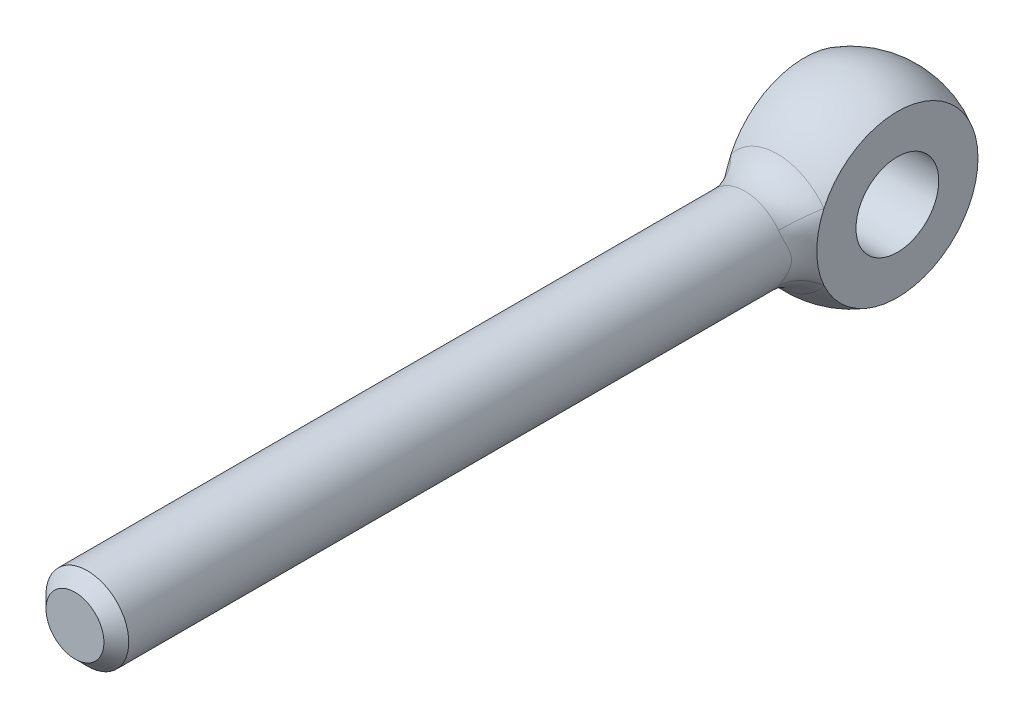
ISO-10303-21;
HEADER;
FILE_DESCRIPTION(('STEP AP214'),'2;1');
FILE_NAME('part.step','',(''),(''),'','','');
FILE_SCHEMA(('AUTOMOTIVE_DESIGN { 1 0 10303 214 1 1 1 1 }'));
ENDSEC;
DATA;
#1=APPLICATION_CONTEXT('core data for automotive mechanical design processes');
#2=APPLICATION_PROTOCOL_DEFINITION('international standard','automotive_design',2000,#1);
#3=PRODUCT_CONTEXT('',#1,'mechanical');
#4=PRODUCT('Part','Part','',(#3));
#5=PRODUCT_RELATED_PRODUCT_CATEGORY('part','',(#4));
#6=PRODUCT_DEFINITION_FORMATION('','',#4);
#7=PRODUCT_DEFINITION_CONTEXT('part definition',#1,'design');
#8=PRODUCT_DEFINITION('design','',#6,#7);
#9=PRODUCT_DEFINITION_SHAPE('','',#8);
#10=(LENGTH_UNIT() NAMED_UNIT(*) SI_UNIT(.MILLI.,.METRE.));
#11=(NAMED_UNIT(*) PLANE_ANGLE_UNIT() SI_UNIT($,.RADIAN.));
#12=(NAMED_UNIT(*) SI_UNIT($,.STERADIAN.) SOLID_ANGLE_UNIT());
#13=UNCERTAINTY_MEASURE_WITH_UNIT(LENGTH_MEASURE(1.E-05),#10,'distance_accuracy_value','');
#14=(GEOMETRIC_REPRESENTATION_CONTEXT(3) GLOBAL_UNCERTAINTY_ASSIGNED_CONTEXT((#13)) GLOBAL_UNIT_ASSIGNED_CONTEXT((#10,
#11,#12)) REPRESENTATION_CONTEXT('',''));
#15=CARTESIAN_POINT('',(0.,0.,0.));
#16=DIRECTION('',(0.,0.,1.));
#17=DIRECTION('',(1.,0.,0.));
#18=AXIS2_PLACEMENT_3D('',#15,#16,#17);
#19=CARTESIAN_POINT('',(0.,0.,0.));
#20=DIRECTION('',(-1.,0.,0.));
#21=DIRECTION('',(0.,0.,-1.));
#22=AXIS2_PLACEMENT_3D('',#19,#20,#21);
#23=SPHERICAL_SURFACE('',#22,9.);
#24=CARTESIAN_POINT('',(4.5,0.,0.));
#25=DIRECTION('',(1.,0.,0.));
#26=DIRECTION('',(0.,0.,1.));
#27=AXIS2_PLACEMENT_3D('',#24,#25,#26);
#28=CIRCLE('',#27,7.79422863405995);
#29=CARTESIAN_POINT('',(4.5,3.22870813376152,7.09404283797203));
#30=VERTEX_POINT('',#29);
#31=CARTESIAN_POINT('',(4.5,-3.22870813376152,7.09404283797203));
#32=VERTEX_POINT('',#31);
#33=EDGE_CURVE('E64',#30,#32,#28,.F.);
#34=ORIENTED_EDGE('',*,*,#33,.T.);
#35=CARTESIAN_POINT('',(0.,0.,7.09404283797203));
#36=DIRECTION('',(0.,0.,-1.));
#37=DIRECTION('',(-1.,0.,0.));
#38=AXIS2_PLACEMENT_3D('',#35,#36,#37);
#39=CIRCLE('',#38,5.53846153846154);
#40=CARTESIAN_POINT('',(-4.5,-3.22870813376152,7.09404283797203));
#41=VERTEX_POINT('',#40);
#42=EDGE_CURVE('E72',#32,#41,#39,.T.);
#43=ORIENTED_EDGE('',*,*,#42,.T.);
#44=CARTESIAN_POINT('',(-4.5,0.,0.));
#45=DIRECTION('',(1.,0.,0.));
#46=DIRECTION('',(0.,0.,1.));
#47=AXIS2_PLACEMENT_3D('',#44,#45,#46);
#48=CIRCLE('',#47,7.79422863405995);
#49=CARTESIAN_POINT('',(-4.5,3.22870813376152,7.09404283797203));
#50=VERTEX_POINT('',#49);
#51=EDGE_CURVE('E60',#50,#41,#48,.F.);
#52=ORIENTED_EDGE('',*,*,#51,.F.);
#53=CARTESIAN_POINT('',(0.,0.,7.09404283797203));
#54=DIRECTION('',(0.,0.,-1.));
#55=DIRECTION('',(-1.,0.,0.));
#56=AXIS2_PLACEMENT_3D('',#53,#54,#55);
#57=CIRCLE('',#56,5.53846153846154);
#58=EDGE_CURVE('E69',#50,#30,#57,.T.);
#59=ORIENTED_EDGE('',*,*,#58,.T.);
#60=EDGE_LOOP('',(#34,#43,#52,#59));
#61=FACE_BOUND('',#60,.T.);
#62=ADVANCED_FACE('F14',(#61),#23,.T.);
#63=CARTESIAN_POINT('',(0.,0.,-10.));
#64=DIRECTION('',(0.,0.,-1.));
#65=DIRECTION('',(1.,0.,0.));
#66=AXIS2_PLACEMENT_3D('',#63,#64,#65);
#67=CYLINDRICAL_SURFACE('',#66,4.);
#68=CARTESIAN_POINT('',(4.5,3.8544457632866,6.77445553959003));
#69=CARTESIAN_POINT('',(3.04270474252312,2.62315350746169,7.93032272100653));
#70=CARTESIAN_POINT('',(2.7741231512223,2.881707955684,10.1296027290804));
#71=CARTESIAN_POINT('',(4.5,3.8063552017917,6.8018140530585));
#72=CARTESIAN_POINT('',(3.05482576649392,2.60369447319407,7.96461619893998));
#73=CARTESIAN_POINT('',(2.81753121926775,2.83992613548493,10.1500330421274));
#74=CARTESIAN_POINT('',(4.5,3.75734620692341,6.82902432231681));
#75=CARTESIAN_POINT('',(3.06839168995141,2.5833163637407,7.99813664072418));
#76=CARTESIAN_POINT('',(2.86015231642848,2.79700081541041,10.1676065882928));
#77=CARTESIAN_POINT('',(4.5,3.65731222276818,6.88311775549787));
#78=CARTESIAN_POINT('',(3.09821295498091,2.54027572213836,8.06327876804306));
#79=CARTESIAN_POINT('',(2.94360667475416,2.70903056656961,10.1973192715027));
#80=CARTESIAN_POINT('',(4.5,3.60628811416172,6.91000105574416));
#81=CARTESIAN_POINT('',(3.11445034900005,2.51763114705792,8.09489992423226));
#82=CARTESIAN_POINT('',(2.98444070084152,2.66398656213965,10.2094607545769));
#83=CARTESIAN_POINT('',(4.5,3.45034294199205,6.98990310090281));
#84=CARTESIAN_POINT('',(3.16665597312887,2.44590984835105,8.18616546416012));
#85=CARTESIAN_POINT('',(3.10362883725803,2.5262969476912,10.2380896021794));
#86=CARTESIAN_POINT('',(4.5,3.34210856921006,7.04242695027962));
#87=CARTESIAN_POINT('',(3.20638316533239,2.39264902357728,8.24298064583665));
#88=CARTESIAN_POINT('',(3.17907335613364,2.43070509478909,10.2469645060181));
#89=CARTESIAN_POINT('',(4.5,3.07131788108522,7.16568134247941));
#90=CARTESIAN_POINT('',(3.30980222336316,2.24847718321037,8.36667989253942));
#91=CARTESIAN_POINT('',(3.3484402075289,2.19463495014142,10.2469316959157));
#92=CARTESIAN_POINT('',(4.5,2.90397618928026,7.23557083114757));
#93=CARTESIAN_POINT('',(3.37687085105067,2.15099293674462,8.42942404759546));
#94=CARTESIAN_POINT('',(3.4381775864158,2.05112903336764,10.2297903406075));
#95=CARTESIAN_POINT('',(4.5,2.63520895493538,7.33585873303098));
#96=CARTESIAN_POINT('',(3.48042901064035,1.97974794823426,8.50775356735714));
#97=CARTESIAN_POINT('',(3.55838650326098,1.82895031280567,10.1852430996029));
#98=CARTESIAN_POINT('',(4.5,2.54243406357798,7.36859815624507));
#99=CARTESIAN_POINT('',(3.51533532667,1.9187130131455,8.53118988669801));
#100=CARTESIAN_POINT('',(3.5961245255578,1.75356165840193,10.1671934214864));
#101=CARTESIAN_POINT('',(4.5,2.35049327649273,7.43205257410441));
#102=CARTESIAN_POINT('',(3.58449538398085,1.7884352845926,8.57274310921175));
#103=CARTESIAN_POINT('',(3.66666176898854,1.60082878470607,10.1262456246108));
#104=CARTESIAN_POINT('',(4.5,2.25132856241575,7.46276794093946));
#105=CARTESIAN_POINT('',(3.61876374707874,1.71923098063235,8.59090327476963));
#106=CARTESIAN_POINT('',(3.69946189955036,1.52348492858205,10.1033484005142));
#107=CARTESIAN_POINT('',(4.5,2.0304613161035,7.52611271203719));
#108=CARTESIAN_POINT('',(3.69027444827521,1.56151844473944,8.62452070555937));
#109=CARTESIAN_POINT('',(3.76469519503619,1.35514764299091,10.0506349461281));
#110=CARTESIAN_POINT('',(4.5,1.90763213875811,7.55831566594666));
#111=CARTESIAN_POINT('',(3.72725176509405,1.47161056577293,8.63921494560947));
#112=CARTESIAN_POINT('',(3.79630400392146,1.26387674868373,10.020296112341));
#113=CARTESIAN_POINT('',(4.5,1.65232180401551,7.61820329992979));
#114=CARTESIAN_POINT('',(3.79632113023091,1.28138713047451,8.66269061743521));
#115=CARTESIAN_POINT('',(3.85283376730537,1.07934568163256,9.95859137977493));
#116=CARTESIAN_POINT('',(4.5,1.51983775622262,7.64588661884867));
#117=CARTESIAN_POINT('',(3.82847639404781,1.18104454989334,8.67151974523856));
#118=CARTESIAN_POINT('',(3.87775270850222,0.986084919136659,9.92722517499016));
#119=CARTESIAN_POINT('',(4.5,1.24584793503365,7.69526663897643));
#120=CARTESIAN_POINT('',(3.88574227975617,0.971416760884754,8.68456342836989));
#121=CARTESIAN_POINT('',(3.92072690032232,0.798212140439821,9.86763071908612));
#122=CARTESIAN_POINT('',(4.5,1.1043877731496,7.71699102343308));
#123=CARTESIAN_POINT('',(3.91095703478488,0.862096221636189,8.68883167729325));
#124=CARTESIAN_POINT('',(3.93881404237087,0.703608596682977,9.83938833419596));
#125=CARTESIAN_POINT('',(4.5,0.812986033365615,7.75309875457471));
#126=CARTESIAN_POINT('',(3.95269307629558,0.635873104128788,8.69452000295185));
#127=CARTESIAN_POINT('',(3.96815692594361,0.51286586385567,9.79055451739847));
#128=CARTESIAN_POINT('',(4.5,0.663048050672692,7.76748518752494));
#129=CARTESIAN_POINT('',(3.96928412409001,0.518825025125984,8.69595666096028));
#130=CARTESIAN_POINT('',(3.97941553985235,0.416727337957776,9.76995986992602));
#131=CARTESIAN_POINT('',(4.5,0.365918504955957,7.78697722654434));
#132=CARTESIAN_POINT('',(3.99168629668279,0.286607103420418,8.69758027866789));
#133=CARTESIAN_POINT('',(3.99451236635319,0.22864233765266,9.74161988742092));
#134=CARTESIAN_POINT('',(4.5,0.219018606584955,7.79254362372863));
#135=CARTESIAN_POINT('',(3.99806921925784,0.171508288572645,8.69783425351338));
#136=CARTESIAN_POINT('',(3.99871971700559,0.13675110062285,9.73323857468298));
#137=CARTESIAN_POINT('',(4.5,-0.0755179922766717,7.79525312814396));
#138=CARTESIAN_POINT('',(4.00117364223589,-0.059112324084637,8.69798034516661));
#139=CARTESIAN_POINT('',(4.00077867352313,-0.0471659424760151,9.72918999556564));
#140=CARTESIAN_POINT('',(4.5,-0.223154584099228,7.79239744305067));
#141=CARTESIAN_POINT('',(3.99790203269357,-0.174838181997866,8.69787274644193));
#142=CARTESIAN_POINT('',(3.99863119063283,-0.139191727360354,9.73352090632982));
#143=CARTESIAN_POINT('',(4.5,-0.515398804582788,7.7785543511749));
#144=CARTESIAN_POINT('',(3.98201549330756,-0.403449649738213,8.69691703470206));
#145=CARTESIAN_POINT('',(3.98800822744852,-0.322967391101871,9.75391826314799));
#146=CARTESIAN_POINT('',(4.5,-0.659988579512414,7.76752813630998));
#147=CARTESIAN_POINT('',(3.9693285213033,-0.516511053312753,8.69606346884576));
#148=CARTESIAN_POINT('',(3.9795025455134,-0.414713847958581,9.77004071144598));
#149=CARTESIAN_POINT('',(4.5,-0.942285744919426,7.73836484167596));
#150=CARTESIAN_POINT('',(3.93569076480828,-0.736344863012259,8.69237263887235));
#151=CARTESIAN_POINT('',(3.95627218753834,-0.596957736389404,9.81071532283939));
#152=CARTESIAN_POINT('',(4.5,-1.07998941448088,7.7202239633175));
#153=CARTESIAN_POINT('',(3.9146841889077,-0.84326203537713,8.68952532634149));
#154=CARTESIAN_POINT('',(3.94154418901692,-0.687454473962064,9.83527198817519));
#155=CARTESIAN_POINT('',(4.5,-1.37588482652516,7.67359136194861));
#156=CARTESIAN_POINT('',(3.86060975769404,-1.07137602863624,8.67936367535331));
#157=CARTESIAN_POINT('',(3.90215083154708,-0.886344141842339,9.89450733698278));
#158=CARTESIAN_POINT('',(4.5,-1.53205619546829,7.64370888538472));
#159=CARTESIAN_POINT('',(3.8258455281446,-1.19066872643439,8.67118584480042));
#160=CARTESIAN_POINT('',(3.87602422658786,-0.994368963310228,9.93022639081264));
#161=CARTESIAN_POINT('',(4.5,-1.83152718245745,7.57753636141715));
#162=CARTESIAN_POINT('',(3.74933129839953,-1.41560295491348,8.64748820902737));
#163=CARTESIAN_POINT('',(3.81488436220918,-1.20788558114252,10.0015265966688));
#164=CARTESIAN_POINT('',(4.5,-1.97482610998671,7.54124597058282));
#165=CARTESIAN_POINT('',(3.70747741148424,-1.52130100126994,8.63189852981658));
#166=CARTESIAN_POINT('',(3.77987062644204,-1.31337724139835,10.0371077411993));
#167=CARTESIAN_POINT('',(4.5,-2.24871161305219,7.46414404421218));
#168=CARTESIAN_POINT('',(3.62012648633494,-1.71797347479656,8.59208691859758));
#169=CARTESIAN_POINT('',(3.70118920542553,-1.5210087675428,10.1029124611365));
#170=CARTESIAN_POINT('',(4.5,-2.37934961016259,7.42335237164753));
#171=CARTESIAN_POINT('',(3.57457235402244,-1.80898132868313,8.56781003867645));
#172=CARTESIAN_POINT('',(3.65755891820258,-1.62316096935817,10.1331581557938));
#173=CARTESIAN_POINT('',(4.5,-2.62960061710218,7.33843673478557));
#174=CARTESIAN_POINT('',(3.48292493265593,-1.97675657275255,8.51005890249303));
#175=CARTESIAN_POINT('',(3.56168882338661,-1.82393375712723,10.1845863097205));
#176=CARTESIAN_POINT('',(4.5,-2.74921736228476,7.29431390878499));
#177=CARTESIAN_POINT('',(3.43680579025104,-2.05343576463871,8.47648952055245));
#178=CARTESIAN_POINT('',(3.50945194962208,-1.92255553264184,10.2057718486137));
#179=CARTESIAN_POINT('',(4.5,-2.94999939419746,7.21498918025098));
#180=CARTESIAN_POINT('',(3.35849710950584,-2.17571119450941,8.4098829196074));
#181=CARTESIAN_POINT('',(3.41071958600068,-2.09141957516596,10.2322288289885));
#182=CARTESIAN_POINT('',(4.5,-3.03332698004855,7.18029900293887));
#183=CARTESIAN_POINT('',(3.32563979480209,-2.22433900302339,8.37868925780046));
#184=CARTESIAN_POINT('',(3.36602915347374,-2.16261785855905,10.2401482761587));
#185=CARTESIAN_POINT('',(4.5,-3.19484965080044,7.10990099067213));
#186=CARTESIAN_POINT('',(3.26272074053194,-2.31453556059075,8.31149265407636));
#187=CARTESIAN_POINT('',(3.27220326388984,-2.3021184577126,10.2480230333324));
#188=CARTESIAN_POINT('',(4.5,-3.27304643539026,7.07419349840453));
#189=CARTESIAN_POINT('',(3.23268360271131,-2.3560481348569,8.2754625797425));
#190=CARTESIAN_POINT('',(3.22306929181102,-2.3704217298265,10.2479809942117));
#191=CARTESIAN_POINT('',(4.5,-3.42565196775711,7.00158146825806));
#192=CARTESIAN_POINT('',(3.17620411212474,-2.43330706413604,8.19857609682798));
#193=CARTESIAN_POINT('',(3.12008076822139,-2.50445754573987,10.2388956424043));
#194=CARTESIAN_POINT('',(4.5,-3.50000806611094,6.96466797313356));
#195=CARTESIAN_POINT('',(3.1498466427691,-2.46892157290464,8.15765508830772));
#196=CARTESIAN_POINT('',(3.06617923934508,-2.5701524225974,10.2297508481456));
#197=CARTESIAN_POINT('',(4.5,-3.64453597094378,6.89013229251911));
#198=CARTESIAN_POINT('',(3.10187955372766,-2.53501235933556,8.07177995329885));
#199=CARTESIAN_POINT('',(2.95455075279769,-2.69775137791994,10.2014354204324));
#200=CARTESIAN_POINT('',(4.5,-3.71470335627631,6.85250941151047));
#201=CARTESIAN_POINT('',(3.08031937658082,-2.56543141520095,8.02681699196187));
#202=CARTESIAN_POINT('',(2.89681988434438,-2.75965145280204,10.1822543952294));
#203=CARTESIAN_POINT('',(4.5,-3.78298226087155,6.81461996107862));
#204=CARTESIAN_POINT('',(3.06161168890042,-2.59377871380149,7.98028977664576));
#205=CARTESIAN_POINT('',(2.83743688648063,-2.81938857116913,10.1576271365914));
#206=(BOUNDED_SURFACE() B_SPLINE_SURFACE(3,2,((#68,#69,#70),(#71,#72,#73),(#74,#75,#76),(#77,
#78,#79),(#80,#81,#82),(#83,#84,#85),(#86,#87,#88),(#89,#90,#91),(#92,#93,#94),(#95,#96,#97),
(#98,#99,#100),(#101,#102,#103),(#104,#105,#106),(#107,#108,#109),(#110,#111,#112),(#113,#114,
#115),(#116,#117,#118),(#119,#120,#121),(#122,#123,#124),(#125,#126,#127),(#128,#129,#130),
(#131,#132,#133),(#134,#135,#136),(#137,#138,#139),(#140,#141,#142),(#143,#144,#145),(#146,#147,
#148),(#149,#150,#151),(#152,#153,#154),(#155,#156,#157),(#158,#159,#160),(#161,#162,#163),
(#164,#165,#166),(#167,#168,#169),(#170,#171,#172),(#173,#174,#175),(#176,#177,#178),(#179,#180,
#181),(#182,#183,#184),(#185,#186,#187),(#188,#189,#190),(#191,#192,#193),(#194,#195,#196),
(#197,#198,#199),(#200,#201,#202),(#203,#204,#205)),.UNSPECIFIED.,.F.,.F.,
.F.) B_SPLINE_SURFACE_WITH_KNOTS((4,2,2,2,2,2,2,2,2,2,2,2,2,2,2,2,2,2,2,2,2,2,4),(3,3),(0.,
0.366533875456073,0.732909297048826,1.46227559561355,2.47457458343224,2.98299508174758,
3.49132182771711,4.07744171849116,4.66373780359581,5.24726215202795,5.8305408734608,
6.38220343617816,6.93378689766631,7.48800717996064,8.04252376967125,8.71711530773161,
9.39174301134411,10.0635045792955,10.7350376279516,11.239494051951,11.7437825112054,
12.2537566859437,12.7642599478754),(0.,1.),
.UNSPECIFIED.) GEOMETRIC_REPRESENTATION_ITEM() RATIONAL_B_SPLINE_SURFACE(((1.,0.873374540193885,
1.),(1.,0.875240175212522,1.),(1.,0.877181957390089,1.),(1.,0.881198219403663,1.),(1.,
0.883272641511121,1.),(1.,0.889648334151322,1.),(1.,0.894119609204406,1.),(1.,0.905097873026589,
1.),(1.,0.911721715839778,1.),(1.,0.921524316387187,1.),(1.,0.924776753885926,1.),(1.,
0.931143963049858,1.),(1.,0.934258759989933,1.),(1.,0.940716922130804,1.),(1.,0.944022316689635,
1.),(1.,0.950179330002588,1.),(1.,0.953030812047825,1.),(1.,0.958111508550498,1.),(1.,
0.96034360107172,1.),(1.,0.964046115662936,1.),(1.,0.965516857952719,1.),(1.,0.967507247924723,
1.),(1.,0.968074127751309,1.),(1.,0.96835024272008,1.),(1.,0.968059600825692,1.),(1.,
0.966647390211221,1.),(1.,0.96552185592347,1.),(1.,0.962536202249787,1.),(1.,0.960675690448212,
1.),(1.,0.955882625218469,1.),(1.,0.952805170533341,1.),(1.,0.945996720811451,1.),(1.,
0.942265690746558,1.),(1.,0.934394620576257,1.),(1.,0.930256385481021,1.),(1.,0.921773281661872,
1.),(1.,0.917428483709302,1.),(1.,0.909818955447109,1.),(1.,0.90655445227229,1.),(1.,
0.900106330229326,1.),(1.,0.896922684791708,1.),(1.,0.890676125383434,1.),(1.,0.887614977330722,
1.),(1.,0.881712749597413,1.),(1.,0.8788719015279,1.),(1.,0.876174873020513,1.))) REPRESENTATION_ITEM('') SURFACE());
#207=CARTESIAN_POINT('',(2.83743688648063,-2.81938857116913,10.1576271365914));
#208=CARTESIAN_POINT('',(2.89681988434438,-2.75965145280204,10.1822543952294));
#209=CARTESIAN_POINT('',(2.95455075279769,-2.69775137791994,10.2014354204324));
#210=CARTESIAN_POINT('',(3.06617923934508,-2.5701524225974,10.2297508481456));
#211=CARTESIAN_POINT('',(3.12008076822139,-2.50445754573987,10.2388956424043));
#212=CARTESIAN_POINT('',(3.22306929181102,-2.3704217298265,10.2479809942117));
#213=CARTESIAN_POINT('',(3.27220326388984,-2.3021184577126,10.2480230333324));
#214=CARTESIAN_POINT('',(3.36602915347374,-2.16261785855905,10.2401482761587));
#215=CARTESIAN_POINT('',(3.41071958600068,-2.09141957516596,10.2322288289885));
#216=CARTESIAN_POINT('',(3.50945194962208,-1.92255553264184,10.2057718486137));
#217=CARTESIAN_POINT('',(3.56168882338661,-1.82393375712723,10.1845863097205));
#218=CARTESIAN_POINT('',(3.65755891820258,-1.62316096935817,10.1331581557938));
#219=CARTESIAN_POINT('',(3.70118920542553,-1.5210087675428,10.1029124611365));
#220=CARTESIAN_POINT('',(3.77987062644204,-1.31337724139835,10.0371077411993));
#221=CARTESIAN_POINT('',(3.81488436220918,-1.20788558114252,10.0015265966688));
#222=CARTESIAN_POINT('',(3.87602422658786,-0.994368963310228,9.93022639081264));
#223=CARTESIAN_POINT('',(3.90215083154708,-0.886344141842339,9.89450733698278));
#224=CARTESIAN_POINT('',(3.94154418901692,-0.687454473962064,9.83527198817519));
#225=CARTESIAN_POINT('',(3.95627218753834,-0.596957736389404,9.81071532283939));
#226=CARTESIAN_POINT('',(3.9795025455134,-0.414713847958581,9.77004071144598));
#227=CARTESIAN_POINT('',(3.98800822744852,-0.322967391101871,9.75391826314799));
#228=CARTESIAN_POINT('',(3.99863119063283,-0.139191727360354,9.73352090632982));
#229=CARTESIAN_POINT('',(4.00077867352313,-0.0471659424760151,9.72918999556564));
#230=CARTESIAN_POINT('',(3.99871971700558,0.13675110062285,9.73323857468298));
#231=CARTESIAN_POINT('',(3.99451236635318,0.22864233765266,9.74161988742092));
#232=CARTESIAN_POINT('',(3.97941553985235,0.416727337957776,9.76995986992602));
#233=CARTESIAN_POINT('',(3.96815692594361,0.51286586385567,9.79055451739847));
#234=CARTESIAN_POINT('',(3.93881404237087,0.703608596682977,9.83938833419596));
#235=CARTESIAN_POINT('',(3.92072690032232,0.798212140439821,9.86763071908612));
#236=CARTESIAN_POINT('',(3.87775270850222,0.986084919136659,9.92722517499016));
#237=CARTESIAN_POINT('',(3.85283376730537,1.07934568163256,9.95859137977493));
#238=CARTESIAN_POINT('',(3.79630400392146,1.26387674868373,10.020296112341));
#239=CARTESIAN_POINT('',(3.76469519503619,1.35514764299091,10.0506349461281));
#240=CARTESIAN_POINT('',(3.69946189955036,1.52348492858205,10.1033484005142));
#241=CARTESIAN_POINT('',(3.66666176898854,1.60082878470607,10.1262456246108));
#242=CARTESIAN_POINT('',(3.5961245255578,1.75356165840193,10.1671934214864));
#243=CARTESIAN_POINT('',(3.55838650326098,1.82895031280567,10.1852430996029));
#244=CARTESIAN_POINT('',(3.4381775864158,2.05112903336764,10.2297903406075));
#245=CARTESIAN_POINT('',(3.3484402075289,2.19463495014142,10.2469316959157));
#246=CARTESIAN_POINT('',(3.17907335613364,2.43070509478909,10.2469645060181));
#247=CARTESIAN_POINT('',(3.10362883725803,2.5262969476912,10.2380896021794));
#248=CARTESIAN_POINT('',(2.98444070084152,2.66398656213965,10.2094607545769));
#249=CARTESIAN_POINT('',(2.94360667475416,2.70903056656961,10.1973192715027));
#250=CARTESIAN_POINT('',(2.86015231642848,2.79700081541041,10.1676065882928));
#251=CARTESIAN_POINT('',(2.81753121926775,2.83992613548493,10.1500330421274));
#252=CARTESIAN_POINT('',(2.7741231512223,2.881707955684,10.1296027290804));
#253=B_SPLINE_CURVE_WITH_KNOTS('',3,(#207,#208,#209,#210,#211,#212,#213,#214,#215,#216,#217,
#218,#219,#220,#221,#222,#223,#224,#225,#226,#227,#228,#229,#230,#231,#232,#233,#234,#235,#236,
#237,#238,#239,#240,#241,#242,#243,#244,#245,#246,#247,#248,#249,#250,#251,#252),.UNSPECIFIED.,
.F.,.F.,(4,2,2,2,2,2,2,2,2,2,2,2,2,2,2,2,2,2,2,2,2,2,4),(0.,0.510503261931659,1.02047743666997,
1.52476589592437,2.02922231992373,2.7007553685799,3.37251693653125,4.04714464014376,
4.72173617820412,5.27625276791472,5.83047305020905,6.3820565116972,6.93371907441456,
7.51699779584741,8.10052214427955,8.6868182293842,9.27293812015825,9.78126486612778,
10.2896853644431,11.3019843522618,12.0313506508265,12.3977260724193,12.7642599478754),.UNSPECIFIED.);
#254=CARTESIAN_POINT('',(3.25,-2.33184476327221,10.2469507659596));
#255=VERTEX_POINT('',#254);
#256=CARTESIAN_POINT('',(3.25,2.3318447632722,10.2469507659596));
#257=VERTEX_POINT('',#256);
#258=EDGE_CURVE('E87',#255,#257,#253,.T.);
#259=ORIENTED_EDGE('',*,*,#258,.T.);
#260=CARTESIAN_POINT('',(0.,0.,10.2469507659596));
#261=DIRECTION('',(0.,0.,-1.));
#262=DIRECTION('',(-1.,0.,0.));
#263=AXIS2_PLACEMENT_3D('',#260,#261,#262);
#264=CIRCLE('',#263,4.);
#265=CARTESIAN_POINT('',(-3.25,2.33184476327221,10.2469507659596));
#266=VERTEX_POINT('',#265);
#267=EDGE_CURVE('E9',#257,#266,#264,.F.);
#268=ORIENTED_EDGE('',*,*,#267,.T.);
#269=CARTESIAN_POINT('',(-4.5,-3.85444584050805,6.77445549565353));
#270=CARTESIAN_POINT('',(-3.04270471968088,-2.62315352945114,7.93032267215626));
#271=CARTESIAN_POINT('',(-2.7741231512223,-2.881707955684,10.1296027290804));
#272=CARTESIAN_POINT('',(-4.5,-3.80635523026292,6.80181403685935));
#273=CARTESIAN_POINT('',(-3.05482575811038,-2.60369448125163,7.9646161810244));
#274=CARTESIAN_POINT('',(-2.81753121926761,-2.83992613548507,10.1500330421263));
#275=CARTESIAN_POINT('',(-4.5,-3.75734621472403,6.82902431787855));
#276=CARTESIAN_POINT('',(-3.06839168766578,-2.58331636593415,7.99813663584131));
#277=CARTESIAN_POINT('',(-2.86015231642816,-2.79700081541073,10.1676065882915));
#278=CARTESIAN_POINT('',(-4.5,-3.65731221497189,6.8831177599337));
#279=CARTESIAN_POINT('',(-3.09821295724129,-2.54027571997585,8.06327877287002));
#280=CARTESIAN_POINT('',(-2.94360667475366,-2.70903056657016,10.1973192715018));
#281=CARTESIAN_POINT('',(-4.5,-3.60628811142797,6.91000105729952));
#282=CARTESIAN_POINT('',(-3.1144503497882,-2.51763114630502,8.09489992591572));
#283=CARTESIAN_POINT('',(-2.98444070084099,-2.66398656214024,10.2094607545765));
#284=CARTESIAN_POINT('',(-4.5,-3.45034294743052,6.98990309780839));
#285=CARTESIAN_POINT('',(-3.16665597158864,-2.44590984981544,8.18616546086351));
#286=CARTESIAN_POINT('',(-3.10362883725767,-2.52629694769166,10.2380896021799));
#287=CARTESIAN_POINT('',(-4.5,-3.34210857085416,7.04242694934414));
#288=CARTESIAN_POINT('',(-3.20638316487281,-2.39264902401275,8.24298064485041));
#289=CARTESIAN_POINT('',(-3.17907335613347,-2.43070509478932,10.2469645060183));
#290=CARTESIAN_POINT('',(-4.5,-3.07131787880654,7.16568134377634));
#291=CARTESIAN_POINT('',(-3.30980222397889,-2.2484771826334,8.36667989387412));
#292=CARTESIAN_POINT('',(-3.3484402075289,-2.19463495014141,10.2469316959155));
#293=CARTESIAN_POINT('',(-4.5,-2.9039761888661,7.2355708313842));
#294=CARTESIAN_POINT('',(-3.37687085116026,-2.15099293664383,8.42942404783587));
#295=CARTESIAN_POINT('',(-3.4381775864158,-2.05112903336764,10.2297903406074));
#296=CARTESIAN_POINT('',(-4.5,-2.63520895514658,7.33585873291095));
#297=CARTESIAN_POINT('',(-3.4804290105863,-1.97974794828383,8.50775356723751));
#298=CARTESIAN_POINT('',(-3.55838650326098,-1.82895031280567,10.1852430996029));
#299=CARTESIAN_POINT('',(-4.5,-2.54243406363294,7.36859815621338));
#300=CARTESIAN_POINT('',(-3.51533532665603,-1.91871301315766,8.53118988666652));
#301=CARTESIAN_POINT('',(-3.5961245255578,-1.75356165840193,10.1671934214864));
#302=CARTESIAN_POINT('',(-4.5,-2.35049327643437,7.43205257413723));
#303=CARTESIAN_POINT('',(-3.58449538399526,-1.78843528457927,8.57274310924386));
#304=CARTESIAN_POINT('',(-3.66666176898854,-1.60082878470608,10.1262456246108));
#305=CARTESIAN_POINT('',(-4.5,-2.25132856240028,7.4627679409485));
#306=CARTESIAN_POINT('',(-3.61876374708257,-1.71923098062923,8.59090327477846));
#307=CARTESIAN_POINT('',(-3.69946189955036,-1.52348492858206,10.1033484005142));
#308=CARTESIAN_POINT('',(-4.5,-2.0304613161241,7.52611271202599));
#309=CARTESIAN_POINT('',(-3.69027444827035,-1.56151844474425,8.62452070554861));
#310=CARTESIAN_POINT('',(-3.76469519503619,-1.35514764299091,10.0506349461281));
#311=CARTESIAN_POINT('',(-4.5,-1.90763213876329,7.55831566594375));
#312=CARTESIAN_POINT('',(-3.72725176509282,-1.471610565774,8.63921494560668));
#313=CARTESIAN_POINT('',(-3.79630400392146,-1.26387674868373,10.020296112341));
#314=CARTESIAN_POINT('',(-4.5,-1.65232180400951,7.6182032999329));
#315=CARTESIAN_POINT('',(-3.79632113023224,-1.28138713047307,8.66269061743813));
#316=CARTESIAN_POINT('',(-3.85283376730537,-1.07934568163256,9.95859137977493));
#317=CARTESIAN_POINT('',(-4.5,-1.51983775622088,7.6458866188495));
#318=CARTESIAN_POINT('',(-3.82847639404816,-1.18104454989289,8.67151974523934));
#319=CARTESIAN_POINT('',(-3.87775270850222,-0.986084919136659,9.92722517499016));
#320=CARTESIAN_POINT('',(-4.5,-1.24584793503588,7.69526663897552));
#321=CARTESIAN_POINT('',(-3.88574227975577,-0.971416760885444,8.68456342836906));
#322=CARTESIAN_POINT('',(-3.92072690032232,-0.798212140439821,9.86763071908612));
#323=CARTESIAN_POINT('',(-4.5,-1.10438777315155,7.71699102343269));
#324=CARTESIAN_POINT('',(-3.91095703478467,-0.862096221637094,8.68883167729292));
#325=CARTESIAN_POINT('',(-3.93881404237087,-0.703608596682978,9.83938833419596));
#326=CARTESIAN_POINT('',(-4.5,-0.812986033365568,7.75309875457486));
#327=CARTESIAN_POINT('',(-3.95269307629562,-0.635873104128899,8.69452000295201));
#328=CARTESIAN_POINT('',(-3.96815692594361,-0.512865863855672,9.79055451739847));
#329=CARTESIAN_POINT('',(-4.5,-0.663048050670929,7.7674851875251));
#330=CARTESIAN_POINT('',(-3.96928412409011,-0.518825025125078,8.69595666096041));
#331=CARTESIAN_POINT('',(-3.97941553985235,-0.416727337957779,9.76995986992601));
#332=CARTESIAN_POINT('',(-4.5,-0.365918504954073,7.78697722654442));
#333=CARTESIAN_POINT('',(-3.99168629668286,-0.286607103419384,8.69758027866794));
#334=CARTESIAN_POINT('',(-3.99451236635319,-0.228642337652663,9.74161988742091));
#335=CARTESIAN_POINT('',(-4.5,-0.219018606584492,7.79254362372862));
#336=CARTESIAN_POINT('',(-3.99806921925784,-0.171508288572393,8.69783425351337));
#337=CARTESIAN_POINT('',(-3.99871971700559,-0.136751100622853,9.73323857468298));
#338=CARTESIAN_POINT('',(-4.5,0.0755179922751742,7.79525312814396));
#339=CARTESIAN_POINT('',(-4.00117364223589,0.0591123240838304,8.69798034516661));
#340=CARTESIAN_POINT('',(-4.00077867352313,0.0471659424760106,9.72918999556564));
#341=CARTESIAN_POINT('',(-4.5,0.223154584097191,7.79239744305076));
#342=CARTESIAN_POINT('',(-3.99790203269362,0.174838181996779,8.69787274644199));
#343=CARTESIAN_POINT('',(-3.99863119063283,0.139191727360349,9.73352090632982));
#344=CARTESIAN_POINT('',(-4.5,0.515398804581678,7.77855435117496));
#345=CARTESIAN_POINT('',(-3.9820154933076,0.403449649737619,8.6969170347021));
#346=CARTESIAN_POINT('',(-3.98800822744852,0.322967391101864,9.75391826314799));
#347=CARTESIAN_POINT('',(-4.5,0.65998857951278,7.76752813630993));
#348=CARTESIAN_POINT('',(-3.96932852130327,0.516511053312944,8.69606346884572));
#349=CARTESIAN_POINT('',(-3.9795025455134,0.414713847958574,9.77004071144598));
#350=CARTESIAN_POINT('',(-4.5,0.94228574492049,7.73836484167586));
#351=CARTESIAN_POINT('',(-3.93569076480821,0.736344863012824,8.69237263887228));
#352=CARTESIAN_POINT('',(-3.95627218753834,0.596957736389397,9.81071532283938));
#353=CARTESIAN_POINT('',(-4.5,1.07998941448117,7.72022396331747));
#354=CARTESIAN_POINT('',(-3.91468418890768,0.843262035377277,8.68952532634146));
#355=CARTESIAN_POINT('',(-3.94154418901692,0.687454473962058,9.83527198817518));
#356=CARTESIAN_POINT('',(-4.5,1.37588482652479,7.67359136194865));
#357=CARTESIAN_POINT('',(-3.86060975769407,1.07137602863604,8.67936367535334));
#358=CARTESIAN_POINT('',(-3.90215083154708,0.886344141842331,9.89450733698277));
#359=CARTESIAN_POINT('',(-4.5,1.53205619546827,7.64370888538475));
#360=CARTESIAN_POINT('',(-3.82584552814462,1.1906687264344,8.67118584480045));
#361=CARTESIAN_POINT('',(-3.87602422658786,0.994368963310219,9.93022639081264));
#362=CARTESIAN_POINT('',(-4.5,1.83152718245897,7.57753636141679));
#363=CARTESIAN_POINT('',(-3.74933129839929,1.41560295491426,8.64748820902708));
#364=CARTESIAN_POINT('',(-3.81488436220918,1.20788558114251,10.0015265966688));
#365=CARTESIAN_POINT('',(-4.5,1.97482610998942,7.54124597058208));
#366=CARTESIAN_POINT('',(-3.70747741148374,1.52130100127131,8.63189852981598));
#367=CARTESIAN_POINT('',(-3.77987062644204,1.31337724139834,10.0371077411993));
#368=CARTESIAN_POINT('',(-4.5,2.24871161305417,7.4641440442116));
#369=CARTESIAN_POINT('',(-3.62012648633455,1.71797347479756,8.59208691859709));
#370=CARTESIAN_POINT('',(-3.70118920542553,1.52100876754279,10.1029124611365));
#371=CARTESIAN_POINT('',(-4.5,2.37934961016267,7.42335237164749));
#372=CARTESIAN_POINT('',(-3.57457235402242,1.80898132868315,8.56781003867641));
#373=CARTESIAN_POINT('',(-3.65755891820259,1.62316096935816,10.1331581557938));
#374=CARTESIAN_POINT('',(-4.5,2.62960061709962,7.33843673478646));
#375=CARTESIAN_POINT('',(-3.48292493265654,1.97675657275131,8.51005890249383));
#376=CARTESIAN_POINT('',(-3.56168882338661,1.82393375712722,10.1845863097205));
#377=CARTESIAN_POINT('',(-4.5,2.74921736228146,7.29431390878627));
#378=CARTESIAN_POINT('',(-3.4368057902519,2.05343576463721,8.47648952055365));
#379=CARTESIAN_POINT('',(-3.50945194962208,1.92255553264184,10.2057718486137));
#380=CARTESIAN_POINT('',(-4.5,2.94999939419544,7.2149891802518));
#381=CARTESIAN_POINT('',(-3.35849710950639,2.1757111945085,8.40988291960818));
#382=CARTESIAN_POINT('',(-3.41071958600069,2.09141957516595,10.2322288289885));
#383=CARTESIAN_POINT('',(-4.5,3.03332698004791,7.18029900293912));
#384=CARTESIAN_POINT('',(-3.32563979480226,2.22433900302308,8.37868925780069));
#385=CARTESIAN_POINT('',(-3.36602915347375,2.16261785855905,10.2401482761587));
#386=CARTESIAN_POINT('',(-4.5,3.19484965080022,7.10990099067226));
#387=CARTESIAN_POINT('',(-3.26272074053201,2.31453556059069,8.3114926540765));
#388=CARTESIAN_POINT('',(-3.27220326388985,2.30211845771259,10.2480230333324));
#389=CARTESIAN_POINT('',(-4.5,3.27304643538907,7.07419349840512));
#390=CARTESIAN_POINT('',(-3.23268360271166,2.35604813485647,8.2754625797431));
#391=CARTESIAN_POINT('',(-3.22306929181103,2.37042172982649,10.2479809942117));
#392=CARTESIAN_POINT('',(-4.5,3.42565196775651,7.00158146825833));
#393=CARTESIAN_POINT('',(-3.17620411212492,2.43330706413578,8.19857609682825));
#394=CARTESIAN_POINT('',(-3.1200807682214,2.50445754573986,10.2388956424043));
#395=CARTESIAN_POINT('',(-4.5,3.50000806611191,6.96466797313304));
#396=CARTESIAN_POINT('',(-3.14984664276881,2.46892157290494,8.15765508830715));
#397=CARTESIAN_POINT('',(-3.06617923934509,2.57015242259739,10.2297508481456));
#398=CARTESIAN_POINT('',(-4.5,3.64453597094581,6.8901322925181));
#399=CARTESIAN_POINT('',(-3.10187955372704,2.53501235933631,8.07177995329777));
#400=CARTESIAN_POINT('',(-2.9545507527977,2.69775137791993,10.2014354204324));
#401=CARTESIAN_POINT('',(-4.5,3.71470335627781,6.85250941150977));
#402=CARTESIAN_POINT('',(-3.08031937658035,2.56543141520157,8.02681699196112));
#403=CARTESIAN_POINT('',(-2.89681988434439,2.75965145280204,10.1822543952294));
#404=CARTESIAN_POINT('',(-4.5,3.78298226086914,6.81461996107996));
#405=CARTESIAN_POINT('',(-3.06161168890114,2.59377871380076,7.98028977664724));
#406=CARTESIAN_POINT('',(-2.83743688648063,2.81938857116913,10.1576271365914));
#407=(BOUNDED_SURFACE() B_SPLINE_SURFACE(3,2,((#269,#270,#271),(#272,#273,#274),(#275,#276,
#277),(#278,#279,#280),(#281,#282,#283),(#284,#285,#286),(#287,#288,#289),(#290,#291,#292),
(#293,#294,#295),(#296,#297,#298),(#299,#300,#301),(#302,#303,#304),(#305,#306,#307),(#308,#309,
#310),(#311,#312,#313),(#314,#315,#316),(#317,#318,#319),(#320,#321,#322),(#323,#324,#325),
(#326,#327,#328),(#329,#330,#331),(#332,#333,#334),(#335,#336,#337),(#338,#339,#340),(#341,#342,
#343),(#344,#345,#346),(#347,#348,#349),(#350,#351,#352),(#353,#354,#355),(#356,#357,#358),
(#359,#360,#361),(#362,#363,#364),(#365,#366,#367),(#368,#369,#370),(#371,#372,#373),(#374,#375,
#376),(#377,#378,#379),(#380,#381,#382),(#383,#384,#385),(#386,#387,#388),(#389,#390,#391),
(#392,#393,#394),(#395,#396,#397),(#398,#399,#400),(#401,#402,#403),(#404,#405,#406)),
.UNSPECIFIED.,.F.,.F.,.F.) B_SPLINE_SURFACE_WITH_KNOTS((4,2,2,2,2,2,2,2,2,2,2,2,2,2,2,2,2,2,2,2,
2,2,4),(3,3),(0.,0.366533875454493,0.732909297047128,1.46227559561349,2.47457458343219,
2.98299508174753,3.49132182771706,4.07744171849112,4.66373780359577,5.24726215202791,
5.83054087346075,6.38220343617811,6.93378689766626,7.48800717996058,8.04252376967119,
8.71711530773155,9.39174301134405,10.0635045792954,10.7350376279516,11.2394940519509,
11.7437825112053,12.2537566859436,12.7642599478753),(0.,1.),
.UNSPECIFIED.) GEOMETRIC_REPRESENTATION_ITEM() RATIONAL_B_SPLINE_SURFACE(((1.,0.873374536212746,
1.),(1.,0.875240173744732,1.),(1.,0.877181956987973,1.),(1.,0.881198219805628,1.),(1.,
0.883272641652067,1.),(1.,0.889648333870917,1.),(1.,0.894119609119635,1.),(1.,0.905097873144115,
1.),(1.,0.911721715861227,1.),(1.,0.921524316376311,1.),(1.,0.92477675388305,1.),(1.,
0.93114396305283,1.),(1.,0.934258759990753,1.),(1.,0.940716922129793,1.),(1.,0.944022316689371,
1.),(1.,0.950179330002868,1.),(1.,0.9530308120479,1.),(1.,0.958111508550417,1.),(1.,
0.960343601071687,1.),(1.,0.96404611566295,1.),(1.,0.965516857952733,1.),(1.,0.967507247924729,
1.),(1.,0.968074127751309,1.),(1.,0.968350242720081,1.),(1.,0.968059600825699,1.),(1.,
0.966647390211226,1.),(1.,0.965521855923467,1.),(1.,0.96253620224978,1.),(1.,0.96067569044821,
1.),(1.,0.955882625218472,1.),(1.,0.952805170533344,1.),(1.,0.945996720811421,1.),(1.,
0.942265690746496,1.),(1.,0.934394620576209,1.),(1.,0.930256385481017,1.),(1.,0.921773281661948,
1.),(1.,0.917428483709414,1.),(1.,0.909818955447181,1.),(1.,0.906554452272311,1.),(1.,
0.900106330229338,1.),(1.,0.896922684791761,1.),(1.,0.890676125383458,1.),(1.,0.887614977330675,
1.),(1.,0.881712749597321,1.),(1.,0.878871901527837,1.),(1.,0.876174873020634,1.))) REPRESENTATION_ITEM('') SURFACE());
#408=CARTESIAN_POINT('',(-2.83743688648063,2.81938857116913,10.1576271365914));
#409=CARTESIAN_POINT('',(-2.89681988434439,2.75965145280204,10.1822543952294));
#410=CARTESIAN_POINT('',(-2.9545507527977,2.69775137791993,10.2014354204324));
#411=CARTESIAN_POINT('',(-3.06617923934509,2.57015242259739,10.2297508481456));
#412=CARTESIAN_POINT('',(-3.1200807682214,2.50445754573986,10.2388956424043));
#413=CARTESIAN_POINT('',(-3.22306929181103,2.37042172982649,10.2479809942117));
#414=CARTESIAN_POINT('',(-3.27220326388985,2.30211845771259,10.2480230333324));
#415=CARTESIAN_POINT('',(-3.36602915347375,2.16261785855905,10.2401482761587));
#416=CARTESIAN_POINT('',(-3.41071958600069,2.09141957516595,10.2322288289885));
#417=CARTESIAN_POINT('',(-3.50945194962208,1.92255553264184,10.2057718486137));
#418=CARTESIAN_POINT('',(-3.56168882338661,1.82393375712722,10.1845863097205));
#419=CARTESIAN_POINT('',(-3.65755891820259,1.62316096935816,10.1331581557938));
#420=CARTESIAN_POINT('',(-3.70118920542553,1.52100876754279,10.1029124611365));
#421=CARTESIAN_POINT('',(-3.77987062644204,1.31337724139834,10.0371077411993));
#422=CARTESIAN_POINT('',(-3.81488436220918,1.20788558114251,10.0015265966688));
#423=CARTESIAN_POINT('',(-3.87602422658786,0.994368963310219,9.93022639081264));
#424=CARTESIAN_POINT('',(-3.90215083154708,0.886344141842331,9.89450733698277));
#425=CARTESIAN_POINT('',(-3.94154418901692,0.687454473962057,9.83527198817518));
#426=CARTESIAN_POINT('',(-3.95627218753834,0.596957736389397,9.81071532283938));
#427=CARTESIAN_POINT('',(-3.9795025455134,0.414713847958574,9.77004071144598));
#428=CARTESIAN_POINT('',(-3.98800822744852,0.322967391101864,9.75391826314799));
#429=CARTESIAN_POINT('',(-3.99863119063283,0.139191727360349,9.73352090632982));
#430=CARTESIAN_POINT('',(-4.00077867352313,0.0471659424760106,9.72918999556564));
#431=CARTESIAN_POINT('',(-3.99871971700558,-0.136751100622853,9.73323857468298));
#432=CARTESIAN_POINT('',(-3.99451236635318,-0.228642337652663,9.74161988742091));
#433=CARTESIAN_POINT('',(-3.97941553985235,-0.416727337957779,9.76995986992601));
#434=CARTESIAN_POINT('',(-3.96815692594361,-0.512865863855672,9.79055451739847));
#435=CARTESIAN_POINT('',(-3.93881404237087,-0.703608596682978,9.83938833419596));
#436=CARTESIAN_POINT('',(-3.92072690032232,-0.798212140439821,9.86763071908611));
#437=CARTESIAN_POINT('',(-3.87775270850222,-0.986084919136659,9.92722517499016));
#438=CARTESIAN_POINT('',(-3.85283376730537,-1.07934568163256,9.95859137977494));
#439=CARTESIAN_POINT('',(-3.79630400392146,-1.26387674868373,10.020296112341));
#440=CARTESIAN_POINT('',(-3.76469519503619,-1.35514764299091,10.0506349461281));
#441=CARTESIAN_POINT('',(-3.69946189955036,-1.52348492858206,10.1033484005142));
#442=CARTESIAN_POINT('',(-3.66666176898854,-1.60082878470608,10.1262456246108));
#443=CARTESIAN_POINT('',(-3.5961245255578,-1.75356165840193,10.1671934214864));
#444=CARTESIAN_POINT('',(-3.55838650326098,-1.82895031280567,10.1852430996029));
#445=CARTESIAN_POINT('',(-3.4381775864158,-2.05112903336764,10.2297903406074));
#446=CARTESIAN_POINT('',(-3.3484402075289,-2.19463495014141,10.2469316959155));
#447=CARTESIAN_POINT('',(-3.17907335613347,-2.43070509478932,10.2469645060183));
#448=CARTESIAN_POINT('',(-3.10362883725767,-2.52629694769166,10.2380896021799));
#449=CARTESIAN_POINT('',(-2.98444070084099,-2.66398656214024,10.2094607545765));
#450=CARTESIAN_POINT('',(-2.94360667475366,-2.70903056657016,10.1973192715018));
#451=CARTESIAN_POINT('',(-2.86015231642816,-2.79700081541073,10.1676065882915));
#452=CARTESIAN_POINT('',(-2.81753121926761,-2.83992613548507,10.1500330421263));
#453=CARTESIAN_POINT('',(-2.7741231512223,-2.881707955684,10.1296027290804));
#454=B_SPLINE_CURVE_WITH_KNOTS('',3,(#408,#409,#410,#411,#412,#413,#414,#415,#416,#417,#418,
#419,#420,#421,#422,#423,#424,#425,#426,#427,#428,#429,#430,#431,#432,#433,#434,#435,#436,#437,
#438,#439,#440,#441,#442,#443,#444,#445,#446,#447,#448,#449,#450,#451,#452,#453),.UNSPECIFIED.,
.F.,.F.,(4,2,2,2,2,2,2,2,2,2,2,2,2,2,2,2,2,2,2,2,2,2,4),(0.,0.510503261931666,1.02047743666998,
1.52476589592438,2.02922231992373,2.7007553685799,3.37251693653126,4.04714464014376,
4.72173617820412,5.27625276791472,5.83047305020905,6.38205651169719,6.93371907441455,
7.5169977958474,8.10052214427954,8.68681822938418,9.27293812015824,9.78126486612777,
10.2896853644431,11.3019843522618,12.0313506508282,12.3977260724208,12.7642599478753),.UNSPECIFIED.);
#455=CARTESIAN_POINT('',(-3.25,-2.33184476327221,10.2469507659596));
#456=VERTEX_POINT('',#455);
#457=EDGE_CURVE('E27',#266,#456,#454,.T.);
#458=ORIENTED_EDGE('',*,*,#457,.T.);
#459=CARTESIAN_POINT('',(0.,0.,10.2469507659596));
#460=DIRECTION('',(0.,0.,-1.));
#461=DIRECTION('',(-1.,0.,0.));
#462=AXIS2_PLACEMENT_3D('',#459,#460,#461);
#463=CIRCLE('',#462,4.);
#464=EDGE_CURVE('E101',#456,#255,#463,.F.);
#465=ORIENTED_EDGE('',*,*,#464,.T.);
#466=EDGE_LOOP('',(#259,#268,#458,#465));
#467=FACE_BOUND('',#466,.T.);
#468=CARTESIAN_POINT('',(0.,0.,73.8));
#469=DIRECTION('',(0.,0.,-1.));
#470=DIRECTION('',(1.,0.,0.));
#471=AXIS2_PLACEMENT_3D('',#468,#469,#470);
#472=CIRCLE('',#471,4.);
#473=CARTESIAN_POINT('',(4.,0.,73.8));
#474=VERTEX_POINT('',#473);
#475=EDGE_CURVE('E85',#474,#474,#472,.T.);
#476=ORIENTED_EDGE('',*,*,#475,.T.);
#477=EDGE_LOOP('',(#476));
#478=FACE_BOUND('',#477,.T.);
#479=ADVANCED_FACE('F107',(#467,#478),#67,.T.);
#480=CARTESIAN_POINT('',(0.,0.,75.));
#481=DIRECTION('',(0.,0.,-1.));
#482=DIRECTION('',(1.,0.,0.));
#483=AXIS2_PLACEMENT_3D('',#480,#481,#482);
#484=CONICAL_SURFACE('',#483,2.8,0.785398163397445);
#485=ORIENTED_EDGE('',*,*,#475,.F.);
#486=EDGE_LOOP('',(#485));
#487=FACE_BOUND('',#486,.T.);
#488=CARTESIAN_POINT('',(0.,0.,75.));
#489=DIRECTION('',(0.,0.,-1.));
#490=DIRECTION('',(1.,0.,0.));
#491=AXIS2_PLACEMENT_3D('',#488,#489,#490);
#492=CIRCLE('',#491,2.8);
#493=CARTESIAN_POINT('',(2.8,0.,75.));
#494=VERTEX_POINT('',#493);
#495=EDGE_CURVE('E73',#494,#494,#492,.T.);
#496=ORIENTED_EDGE('',*,*,#495,.T.);
#497=EDGE_LOOP('',(#496));
#498=FACE_BOUND('',#497,.T.);
#499=ADVANCED_FACE('F111',(#487,#498),#484,.T.);
#500=CARTESIAN_POINT('',(0.,-2.8,75.));
#501=DIRECTION('',(0.,0.,1.));
#502=DIRECTION('',(-1.,0.,0.));
#503=AXIS2_PLACEMENT_3D('',#500,#501,#502);
#504=PLANE('',#503);
#505=ORIENTED_EDGE('',*,*,#495,.F.);
#506=EDGE_LOOP('',(#505));
#507=FACE_BOUND('',#506,.T.);
#508=ADVANCED_FACE('F158',(#507),#504,.T.);
#509=CARTESIAN_POINT('',(-4.5,15.,-10.));
#510=DIRECTION('',(1.,0.,0.));
#511=DIRECTION('',(0.,0.,1.));
#512=AXIS2_PLACEMENT_3D('',#509,#510,#511);
#513=PLANE('',#512);
#514=CARTESIAN_POINT('',(-4.5,0.,0.));
#515=DIRECTION('',(1.,0.,0.));
#516=DIRECTION('',(0.,0.,1.));
#517=AXIS2_PLACEMENT_3D('',#514,#515,#516);
#518=CIRCLE('',#517,4.);
#519=CARTESIAN_POINT('',(-4.5,0.,4.));
#520=VERTEX_POINT('',#519);
#521=EDGE_CURVE('E253',#520,#520,#518,.T.);
#522=ORIENTED_EDGE('',*,*,#521,.T.);
#523=EDGE_LOOP('',(#522));
#524=FACE_BOUND('',#523,.T.);
#525=ORIENTED_EDGE('',*,*,#51,.T.);
#526=EDGE_CURVE('E57',#41,#50,#48,.F.);
#527=ORIENTED_EDGE('',*,*,#526,.T.);
#528=EDGE_LOOP('',(#525,#527));
#529=FACE_BOUND('',#528,.T.);
#530=ADVANCED_FACE('F59',(#524,#529),#513,.F.);
#531=CARTESIAN_POINT('',(4.5,15.,-10.));
#532=DIRECTION('',(1.,0.,0.));
#533=DIRECTION('',(0.,0.,1.));
#534=AXIS2_PLACEMENT_3D('',#531,#532,#533);
#535=PLANE('',#534);
#536=CARTESIAN_POINT('',(4.5,0.,0.));
#537=DIRECTION('',(1.,0.,0.));
#538=DIRECTION('',(0.,0.,1.));
#539=AXIS2_PLACEMENT_3D('',#536,#537,#538);
#540=CIRCLE('',#539,4.);
#541=CARTESIAN_POINT('',(4.5,0.,4.));
#542=VERTEX_POINT('',#541);
#543=EDGE_CURVE('E78',#542,#542,#540,.T.);
#544=ORIENTED_EDGE('',*,*,#543,.F.);
#545=EDGE_LOOP('',(#544));
#546=FACE_BOUND('',#545,.T.);
#547=ORIENTED_EDGE('',*,*,#33,.F.);
#548=EDGE_CURVE('E249',#32,#30,#28,.F.);
#549=ORIENTED_EDGE('',*,*,#548,.F.);
#550=EDGE_LOOP('',(#547,#549));
#551=FACE_BOUND('',#550,.T.);
#552=ADVANCED_FACE('F151',(#546,#551),#535,.T.);
#553=CARTESIAN_POINT('',(10.,0.,0.));
#554=DIRECTION('',(-1.,0.,0.));
#555=DIRECTION('',(0.,0.,-1.));
#556=AXIS2_PLACEMENT_3D('',#553,#554,#555);
#557=CYLINDRICAL_SURFACE('',#556,4.);
#558=ORIENTED_EDGE('',*,*,#543,.T.);
#559=EDGE_LOOP('',(#558));
#560=FACE_BOUND('',#559,.T.);
#561=ORIENTED_EDGE('',*,*,#521,.F.);
#562=EDGE_LOOP('',(#561));
#563=FACE_BOUND('',#562,.T.);
#564=ADVANCED_FACE('F126',(#560,#563),#557,.F.);
#565=CARTESIAN_POINT('',(-6.5,-4.66368952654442,10.2469507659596));
#566=DIRECTION('',(0.582961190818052,-0.8125,0.));
#567=DIRECTION('',(0.8125,0.582961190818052,0.));
#568=AXIS2_PLACEMENT_3D('',#565,#566,#567);
#569=CIRCLE('',#568,4.);
#570=EDGE_CURVE('E79',#456,#41,#569,.F.);
#571=ORIENTED_EDGE('',*,*,#570,.F.);
#572=ORIENTED_EDGE('',*,*,#457,.F.);
#573=CARTESIAN_POINT('',(-6.5,4.66368952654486,10.2469507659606));
#574=DIRECTION('',(-0.582961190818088,-0.812499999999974,0.));
#575=DIRECTION('',(0.812499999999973,-0.582961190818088,0.));
#576=AXIS2_PLACEMENT_3D('',#573,#574,#575);
#577=CIRCLE('',#576,4.);
#578=EDGE_CURVE('E75',#50,#266,#577,.T.);
#579=ORIENTED_EDGE('',*,*,#578,.F.);
#580=ORIENTED_EDGE('',*,*,#526,.F.);
#581=EDGE_LOOP('',(#571,#572,#579,#580));
#582=FACE_BOUND('',#581,.T.);
#583=ADVANCED_FACE('F76',(#582),#407,.F.);
#584=CARTESIAN_POINT('',(0.,0.,10.2469507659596));
#585=DIRECTION('',(0.,0.,-1.));
#586=DIRECTION('',(-1.,0.,0.));
#587=AXIS2_PLACEMENT_3D('',#584,#585,#586);
#588=TOROIDAL_SURFACE('',#587,8.,4.);
#589=ORIENTED_EDGE('',*,*,#578,.T.);
#590=ORIENTED_EDGE('',*,*,#267,.F.);
#591=CARTESIAN_POINT('',(6.5,4.66368952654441,10.2469507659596));
#592=DIRECTION('',(-0.582961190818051,0.8125,0.));
#593=DIRECTION('',(-0.8125,-0.582961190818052,0.));
#594=AXIS2_PLACEMENT_3D('',#591,#592,#593);
#595=CIRCLE('',#594,4.);
#596=EDGE_CURVE('E83',#30,#257,#595,.T.);
#597=ORIENTED_EDGE('',*,*,#596,.F.);
#598=ORIENTED_EDGE('',*,*,#58,.F.);
#599=EDGE_LOOP('',(#589,#590,#597,#598));
#600=FACE_BOUND('',#599,.T.);
#601=ADVANCED_FACE('F82',(#600),#588,.F.);
#602=CARTESIAN_POINT('',(0.,0.,10.2469507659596));
#603=DIRECTION('',(0.,0.,-1.));
#604=DIRECTION('',(-1.,0.,0.));
#605=AXIS2_PLACEMENT_3D('',#602,#603,#604);
#606=TOROIDAL_SURFACE('',#605,8.,4.);
#607=ORIENTED_EDGE('',*,*,#570,.T.);
#608=ORIENTED_EDGE('',*,*,#42,.F.);
#609=CARTESIAN_POINT('',(6.5,-4.66368952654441,10.2469507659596));
#610=DIRECTION('',(-0.582961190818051,-0.8125,0.));
#611=DIRECTION('',(0.8125,-0.582961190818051,0.));
#612=AXIS2_PLACEMENT_3D('',#609,#610,#611);
#613=CIRCLE('',#612,4.);
#614=EDGE_CURVE('E136',#255,#32,#613,.T.);
#615=ORIENTED_EDGE('',*,*,#614,.F.);
#616=ORIENTED_EDGE('',*,*,#464,.F.);
#617=EDGE_LOOP('',(#607,#608,#615,#616));
#618=FACE_BOUND('',#617,.T.);
#619=ADVANCED_FACE('F226',(#618),#606,.F.);
#620=ORIENTED_EDGE('',*,*,#596,.T.);
#621=ORIENTED_EDGE('',*,*,#258,.F.);
#622=ORIENTED_EDGE('',*,*,#614,.T.);
#623=ORIENTED_EDGE('',*,*,#548,.T.);
#624=EDGE_LOOP('',(#620,#621,#622,#623));
#625=FACE_BOUND('',#624,.T.);
#626=ADVANCED_FACE('F116',(#625),#206,.F.);
#627=CLOSED_SHELL('',(#62,#479,#499,#508,#530,#552,#564,#583,#601,#619,#626));
#628=MANIFOLD_SOLID_BREP('B1',#627);
#629=ADVANCED_BREP_SHAPE_REPRESENTATION('',(#18,#628),#14);
#630=SHAPE_DEFINITION_REPRESENTATION(#9,#629);
ENDSEC;
END-ISO-10303-21;
